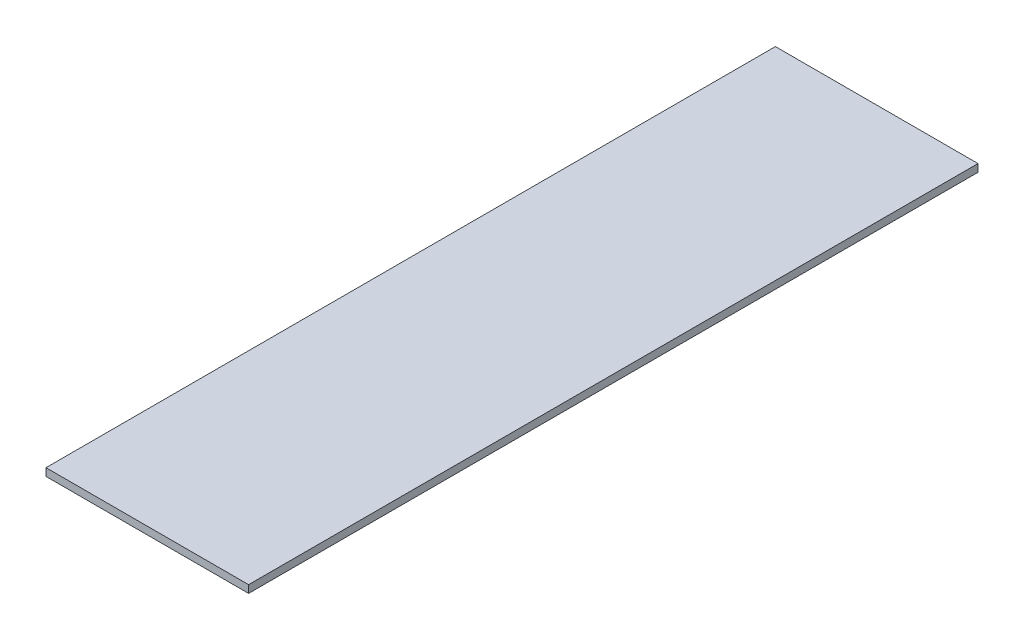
ISO-10303-21;
HEADER;
FILE_DESCRIPTION(('STEP AP214'),'2;1');
FILE_NAME('part.step','',(''),(''),'','','');
FILE_SCHEMA(('AUTOMOTIVE_DESIGN { 1 0 10303 214 1 1 1 1 }'));
ENDSEC;
DATA;
#1=APPLICATION_CONTEXT('core data for automotive mechanical design processes');
#2=APPLICATION_PROTOCOL_DEFINITION('international standard','automotive_design',2000,#1);
#3=PRODUCT_CONTEXT('',#1,'mechanical');
#4=PRODUCT('Part','Part','',(#3));
#5=PRODUCT_RELATED_PRODUCT_CATEGORY('part','',(#4));
#6=PRODUCT_DEFINITION_FORMATION('','',#4);
#7=PRODUCT_DEFINITION_CONTEXT('part definition',#1,'design');
#8=PRODUCT_DEFINITION('design','',#6,#7);
#9=PRODUCT_DEFINITION_SHAPE('','',#8);
#10=(LENGTH_UNIT() NAMED_UNIT(*) SI_UNIT(.MILLI.,.METRE.));
#11=(NAMED_UNIT(*) PLANE_ANGLE_UNIT() SI_UNIT($,.RADIAN.));
#12=(NAMED_UNIT(*) SI_UNIT($,.STERADIAN.) SOLID_ANGLE_UNIT());
#13=UNCERTAINTY_MEASURE_WITH_UNIT(LENGTH_MEASURE(1.E-05),#10,'distance_accuracy_value','');
#14=(GEOMETRIC_REPRESENTATION_CONTEXT(3) GLOBAL_UNCERTAINTY_ASSIGNED_CONTEXT((#13)) GLOBAL_UNIT_ASSIGNED_CONTEXT((#10,
#11,#12)) REPRESENTATION_CONTEXT('',''));
#15=CARTESIAN_POINT('',(0.,0.,0.));
#16=DIRECTION('',(0.,0.,1.));
#17=DIRECTION('',(1.,0.,0.));
#18=AXIS2_PLACEMENT_3D('',#15,#16,#17);
#19=CARTESIAN_POINT('',(0.,4.7625,0.));
#20=DIRECTION('',(1.,0.,0.));
#21=DIRECTION('',(0.,0.,-1.));
#22=AXIS2_PLACEMENT_3D('',#19,#20,#21);
#23=PLANE('',#22);
#24=DIRECTION('',(0.,0.,1.));
#25=VECTOR('',#24,1.);
#26=CARTESIAN_POINT('',(0.,0.,0.));
#27=LINE('',#26,#25);
#28=CARTESIAN_POINT('',(0.,0.,-457.2));
#29=VERTEX_POINT('',#28);
#30=CARTESIAN_POINT('',(0.,0.,0.));
#31=VERTEX_POINT('',#30);
#32=EDGE_CURVE('E96',#29,#31,#27,.T.);
#33=ORIENTED_EDGE('',*,*,#32,.T.);
#34=DIRECTION('',(0.,-1.,0.));
#35=VECTOR('',#34,1.);
#36=CARTESIAN_POINT('',(0.,4.7625,0.));
#37=LINE('',#36,#35);
#38=CARTESIAN_POINT('',(0.,4.7625,0.));
#39=VERTEX_POINT('',#38);
#40=EDGE_CURVE('E11',#39,#31,#37,.T.);
#41=ORIENTED_EDGE('',*,*,#40,.F.);
#42=DIRECTION('',(0.,0.,1.));
#43=VECTOR('',#42,1.);
#44=CARTESIAN_POINT('',(0.,4.7625,0.));
#45=LINE('',#44,#43);
#46=CARTESIAN_POINT('',(0.,4.7625,-457.2));
#47=VERTEX_POINT('',#46);
#48=EDGE_CURVE('E84',#47,#39,#45,.T.);
#49=ORIENTED_EDGE('',*,*,#48,.F.);
#50=DIRECTION('',(0.,-1.,0.));
#51=VECTOR('',#50,1.);
#52=CARTESIAN_POINT('',(0.,4.7625,-457.2));
#53=LINE('',#52,#51);
#54=EDGE_CURVE('E92',#47,#29,#53,.T.);
#55=ORIENTED_EDGE('',*,*,#54,.T.);
#56=EDGE_LOOP('',(#33,#41,#49,#55));
#57=FACE_BOUND('',#56,.T.);
#58=ADVANCED_FACE('F33',(#57),#23,.F.);
#59=CARTESIAN_POINT('',(0.,4.7625,0.));
#60=DIRECTION('',(0.,0.,-1.));
#61=DIRECTION('',(-1.,0.,0.));
#62=AXIS2_PLACEMENT_3D('',#59,#60,#61);
#63=PLANE('',#62);
#64=DIRECTION('',(1.,0.,0.));
#65=VECTOR('',#64,1.);
#66=CARTESIAN_POINT('',(0.,0.,0.));
#67=LINE('',#66,#65);
#68=CARTESIAN_POINT('',(127.,0.,0.));
#69=VERTEX_POINT('',#68);
#70=EDGE_CURVE('E88',#31,#69,#67,.T.);
#71=ORIENTED_EDGE('',*,*,#70,.T.);
#72=DIRECTION('',(0.,-1.,0.));
#73=VECTOR('',#72,1.);
#74=CARTESIAN_POINT('',(127.,4.7625,0.));
#75=LINE('',#74,#73);
#76=CARTESIAN_POINT('',(127.,4.7625,0.));
#77=VERTEX_POINT('',#76);
#78=EDGE_CURVE('E41',#77,#69,#75,.T.);
#79=ORIENTED_EDGE('',*,*,#78,.F.);
#80=DIRECTION('',(1.,0.,0.));
#81=VECTOR('',#80,1.);
#82=CARTESIAN_POINT('',(0.,4.7625,0.));
#83=LINE('',#82,#81);
#84=EDGE_CURVE('E79',#39,#77,#83,.T.);
#85=ORIENTED_EDGE('',*,*,#84,.F.);
#86=ORIENTED_EDGE('',*,*,#40,.T.);
#87=EDGE_LOOP('',(#71,#79,#85,#86));
#88=FACE_BOUND('',#87,.T.);
#89=ADVANCED_FACE('F87',(#88),#63,.F.);
#90=CARTESIAN_POINT('',(127.,4.7625,0.));
#91=DIRECTION('',(-1.,0.,0.));
#92=DIRECTION('',(0.,0.,1.));
#93=AXIS2_PLACEMENT_3D('',#90,#91,#92);
#94=PLANE('',#93);
#95=DIRECTION('',(0.,0.,-1.));
#96=VECTOR('',#95,1.);
#97=CARTESIAN_POINT('',(127.,0.,0.));
#98=LINE('',#97,#96);
#99=CARTESIAN_POINT('',(127.,0.,-457.2));
#100=VERTEX_POINT('',#99);
#101=EDGE_CURVE('E66',#69,#100,#98,.T.);
#102=ORIENTED_EDGE('',*,*,#101,.T.);
#103=DIRECTION('',(0.,-1.,0.));
#104=VECTOR('',#103,1.);
#105=CARTESIAN_POINT('',(127.,4.7625,-457.2));
#106=LINE('',#105,#104);
#107=CARTESIAN_POINT('',(127.,4.7625,-457.2));
#108=VERTEX_POINT('',#107);
#109=EDGE_CURVE('E89',#108,#100,#106,.T.);
#110=ORIENTED_EDGE('',*,*,#109,.F.);
#111=DIRECTION('',(0.,0.,-1.));
#112=VECTOR('',#111,1.);
#113=CARTESIAN_POINT('',(127.,4.7625,0.));
#114=LINE('',#113,#112);
#115=EDGE_CURVE('E82',#77,#108,#114,.T.);
#116=ORIENTED_EDGE('',*,*,#115,.F.);
#117=ORIENTED_EDGE('',*,*,#78,.T.);
#118=EDGE_LOOP('',(#102,#110,#116,#117));
#119=FACE_BOUND('',#118,.T.);
#120=ADVANCED_FACE('F90',(#119),#94,.F.);
#121=CARTESIAN_POINT('',(0.,4.7625,-457.2));
#122=DIRECTION('',(0.,0.,1.));
#123=DIRECTION('',(1.,0.,0.));
#124=AXIS2_PLACEMENT_3D('',#121,#122,#123);
#125=PLANE('',#124);
#126=DIRECTION('',(-1.,0.,0.));
#127=VECTOR('',#126,1.);
#128=CARTESIAN_POINT('',(0.,0.,-457.2));
#129=LINE('',#128,#127);
#130=EDGE_CURVE('E72',#100,#29,#129,.T.);
#131=ORIENTED_EDGE('',*,*,#130,.T.);
#132=ORIENTED_EDGE('',*,*,#54,.F.);
#133=DIRECTION('',(-1.,0.,0.));
#134=VECTOR('',#133,1.);
#135=CARTESIAN_POINT('',(0.,4.7625,-457.2));
#136=LINE('',#135,#134);
#137=EDGE_CURVE('E49',#108,#47,#136,.T.);
#138=ORIENTED_EDGE('',*,*,#137,.F.);
#139=ORIENTED_EDGE('',*,*,#109,.T.);
#140=EDGE_LOOP('',(#131,#132,#138,#139));
#141=FACE_BOUND('',#140,.T.);
#142=ADVANCED_FACE('F103',(#141),#125,.F.);
#143=CARTESIAN_POINT('',(0.,4.7625,0.));
#144=DIRECTION('',(0.,-1.,0.));
#145=DIRECTION('',(0.,0.,-1.));
#146=AXIS2_PLACEMENT_3D('',#143,#144,#145);
#147=PLANE('',#146);
#148=ORIENTED_EDGE('',*,*,#48,.T.);
#149=ORIENTED_EDGE('',*,*,#84,.T.);
#150=ORIENTED_EDGE('',*,*,#115,.T.);
#151=ORIENTED_EDGE('',*,*,#137,.T.);
#152=EDGE_LOOP('',(#148,#149,#150,#151));
#153=FACE_BOUND('',#152,.T.);
#154=ADVANCED_FACE('F80',(#153),#147,.F.);
#155=CARTESIAN_POINT('',(0.,0.,0.));
#156=DIRECTION('',(0.,-1.,0.));
#157=DIRECTION('',(0.,0.,-1.));
#158=AXIS2_PLACEMENT_3D('',#155,#156,#157);
#159=PLANE('',#158);
#160=ORIENTED_EDGE('',*,*,#32,.F.);
#161=ORIENTED_EDGE('',*,*,#130,.F.);
#162=ORIENTED_EDGE('',*,*,#101,.F.);
#163=ORIENTED_EDGE('',*,*,#70,.F.);
#164=EDGE_LOOP('',(#160,#161,#162,#163));
#165=FACE_BOUND('',#164,.T.);
#166=ADVANCED_FACE('F106',(#165),#159,.T.);
#167=CLOSED_SHELL('',(#58,#89,#120,#142,#154,#166));
#168=MANIFOLD_SOLID_BREP('B2',#167);
#169=ADVANCED_BREP_SHAPE_REPRESENTATION('',(#18,#168),#14);
#170=SHAPE_DEFINITION_REPRESENTATION(#9,#169);
ENDSEC;
END-ISO-10303-21;
